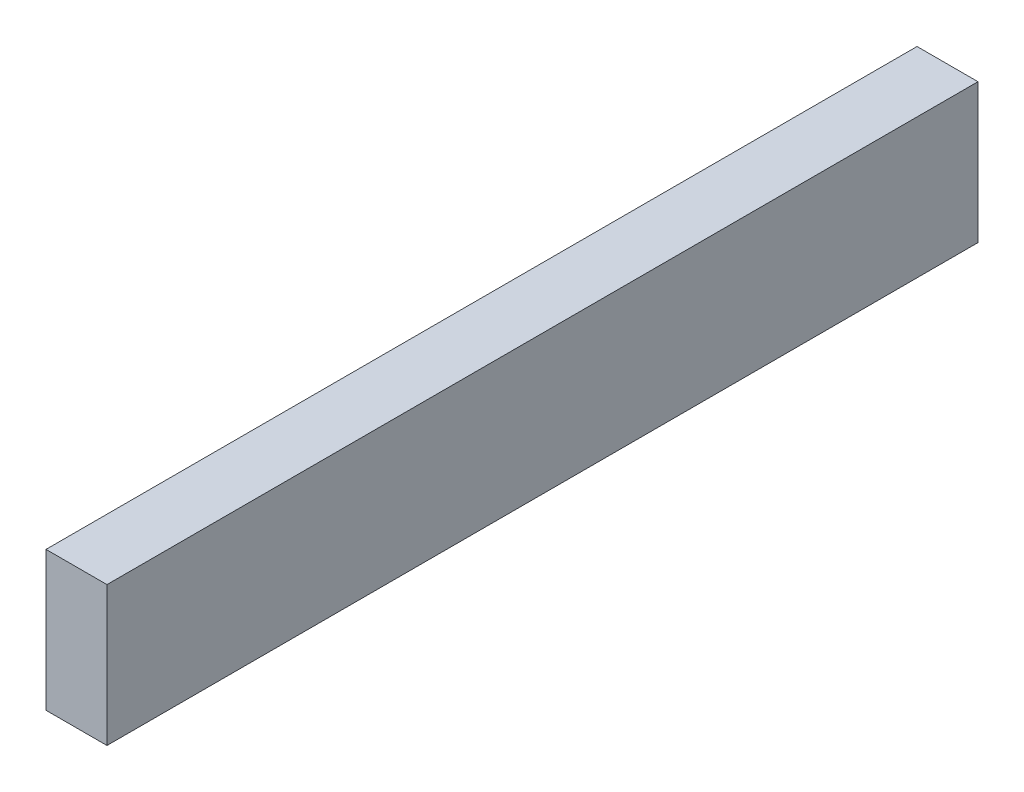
from build123d import *

# Parameters (mm, degrees)
ESQUISSE1_W      = 14
ESQUISSE1_H      = 32
EXTRUSION1_DEPTH = 200


with BuildPart() as part:
    # Esquisse1 → Extrusion1 (new body)
    with BuildSketch(Plane.XY):
        with Locations((-51.63471223, -34.091906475)):
            Rectangle(ESQUISSE1_W, ESQUISSE1_H)
    extrude(amount=EXTRUSION1_DEPTH)


solid = part.part
